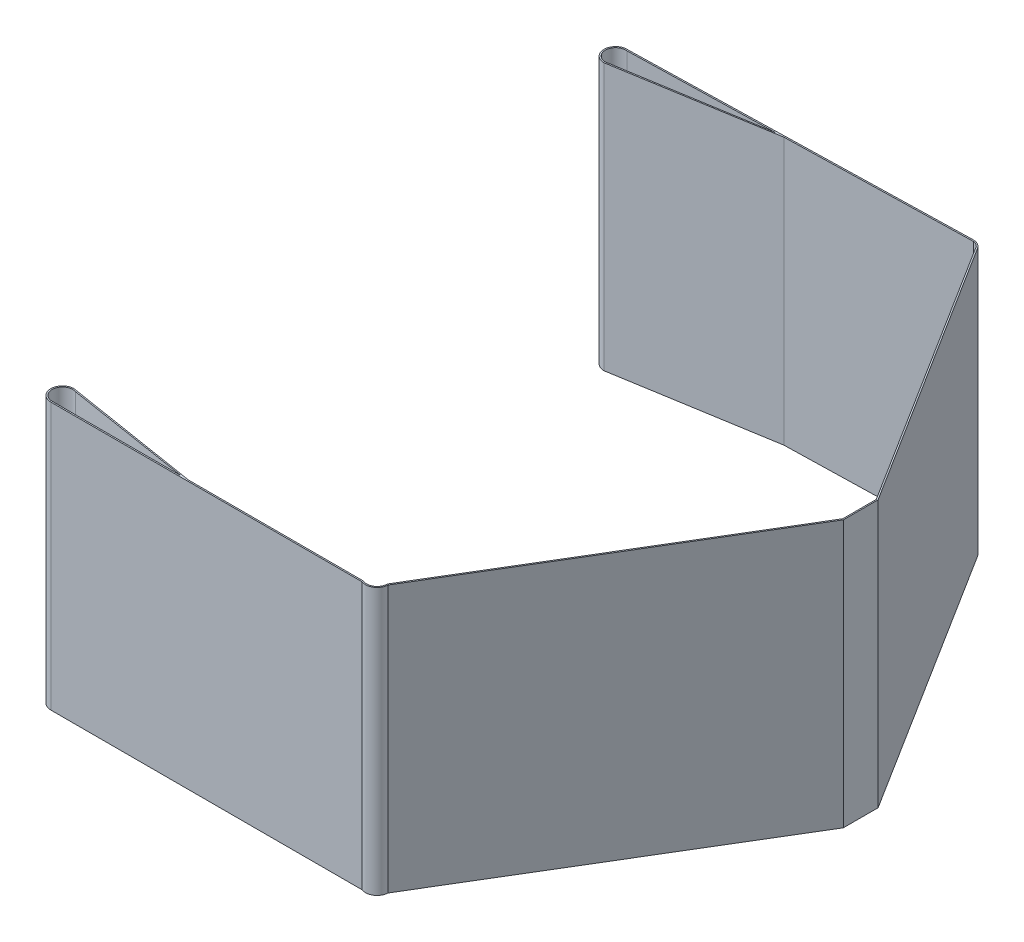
from build123d import *

# Parameters (mm, degrees)
ESQUISSE1_W      = 455
ESQUISSE1_H      = 390
EXTRUSION1_DEPTH = 2
EXTRUSION2_DEPTH = 390
EXTRUSION3_DEPTH = 390
EXTRUSION4_DEPTH = 390
EXTRUSION7_DEPTH = 390
EXTRUSION8_DEPTH = 390


with BuildPart() as part:
    # Esquisse1 → Extrusion1 (new body)
    with BuildSketch(Plane.XY):
        with Locations((227.5, 195)):
            Rectangle(ESQUISSE1_W, ESQUISSE1_H)
    extrude(amount=EXTRUSION1_DEPTH)

    # Esquisse2 → Extrusion2 (add)
    with BuildSketch(Plane(origin=(0, 390, 0), x_dir=(1, 0, 0), z_dir=(0, 1, 0))):
        with BuildLine():
            Line((199.427806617, 0), (189.005850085, 0))
            Line((189.005850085, 0), (4.675963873, 29.252556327))
            ThreePointArc((4.675963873, 29.252556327), (-14.811960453, 17.367662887), (0, 0))
            Line((0, 0), (0, -2))
            ThreePointArc((0, -2), (-17, 15), (0, 32))
            Line((0, 32), (199.427806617, 0))
        make_face()
    extrude(amount=-EXTRUSION2_DEPTH)

    # Esquisse3 → Extrusion3 (add)
    with BuildSketch(Plane(origin=(0, 390, 0), x_dir=(1, 0, 0), z_dir=(0, 1, 0))):
        with BuildLine():
            Line((478.222741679, 12.95862456), (728.523926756, 428.379274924))
            Line((728.523926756, 428.379274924), (726.70295468, 429.232369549))
            Line((726.70295468, 429.232369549), (476.401769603, 13.811719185))
            ThreePointArc((476.401769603, 13.811719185), (469.463241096, 1.075949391), (455, 0))
            Line((455, 0), (455, -2))
            ThreePointArc((455, -2), (470.449976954, -0.479989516), (478.222741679, 12.95862456))
        make_face()
    extrude(amount=-EXTRUSION3_DEPTH)

    # Esquisse4 → Extrusion4 (add)
    with BuildSketch(Plane(origin=(0, 390, 0), x_dir=(1, 0, 0), z_dir=(0, 1, 0))):
        Polygon((479.445428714, 871.784030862), (726.70295468, 478.232369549), (726.70295468, 429.232369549), (728.523926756, 428.379274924), (728.523926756, 479.093458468), (481.807398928, 871.784030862), align=None)
    extrude(amount=-EXTRUSION4_DEPTH)

    # Esquisse8 → Extrusion7 (add)
    with BuildSketch(Plane(origin=(0, 390, 0), x_dir=(1, 0, 0), z_dir=(0, 1, 0))):
        with BuildLine():
            Line((468.864516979, 877.901801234), (-23.434830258, 865.956237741))
            Line((-23.434830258, 865.956237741), (-23.434989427, 863.955645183))
            Line((-23.434989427, 863.955645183), (471.259727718, 875.959331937))
            ThreePointArc((471.259727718, 875.959331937), (475.680177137, 874.513940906), (479.445428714, 871.784030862))
            Line((479.445428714, 871.784030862), (481.807398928, 871.784030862))
            ThreePointArc((481.807398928, 871.784030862), (476.022472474, 876.295320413), (468.864516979, 877.901801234))
        make_face()
    extrude(amount=-EXTRUSION7_DEPTH)

    # Esquisse9 → Extrusion8 (add)
    with BuildSketch(Plane(origin=(0, 390, 0), x_dir=(1, 0, 0), z_dir=(0, 1, 0))):
        with BuildLine():
            Line((-23.434989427, 863.955645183), (-23.434830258, 865.956237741))
            ThreePointArc((-23.434830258, 865.956237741), (-42.22117113, 849.979869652), (-25.258207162, 832.079344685))
            Line((-25.258207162, 832.079344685), (200.595421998, 869.391706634))
            Line((200.595421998, 869.391706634), (189.005850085, 869.110487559))
            Line((189.005850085, 869.110487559), (-25.258207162, 834.066861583))
            ThreePointArc((-25.258207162, 834.066861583), (-40.230377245, 849.980164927), (-23.434989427, 863.955645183))
        make_face()
    extrude(amount=-EXTRUSION8_DEPTH)


solid = part.part
